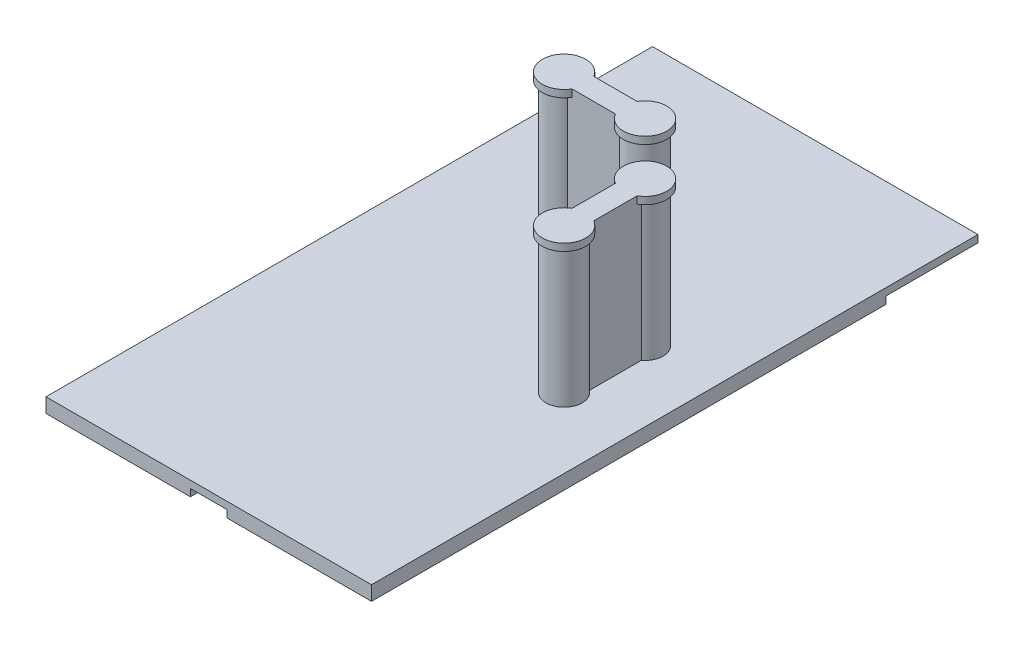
ISO-10303-21;
HEADER;
FILE_DESCRIPTION(('STEP AP214'),'2;1');
FILE_NAME('part.step','',(''),(''),'','','');
FILE_SCHEMA(('AUTOMOTIVE_DESIGN { 1 0 10303 214 1 1 1 1 }'));
ENDSEC;
DATA;
#1=APPLICATION_CONTEXT('core data for automotive mechanical design processes');
#2=APPLICATION_PROTOCOL_DEFINITION('international standard','automotive_design',2000,#1);
#3=PRODUCT_CONTEXT('',#1,'mechanical');
#4=PRODUCT('Part','Part','',(#3));
#5=PRODUCT_RELATED_PRODUCT_CATEGORY('part','',(#4));
#6=PRODUCT_DEFINITION_FORMATION('','',#4);
#7=PRODUCT_DEFINITION_CONTEXT('part definition',#1,'design');
#8=PRODUCT_DEFINITION('design','',#6,#7);
#9=PRODUCT_DEFINITION_SHAPE('','',#8);
#10=(LENGTH_UNIT() NAMED_UNIT(*) SI_UNIT(.MILLI.,.METRE.));
#11=(NAMED_UNIT(*) PLANE_ANGLE_UNIT() SI_UNIT($,.RADIAN.));
#12=(NAMED_UNIT(*) SI_UNIT($,.STERADIAN.) SOLID_ANGLE_UNIT());
#13=UNCERTAINTY_MEASURE_WITH_UNIT(LENGTH_MEASURE(1.E-05),#10,'distance_accuracy_value','');
#14=(GEOMETRIC_REPRESENTATION_CONTEXT(3) GLOBAL_UNCERTAINTY_ASSIGNED_CONTEXT((#13)) GLOBAL_UNIT_ASSIGNED_CONTEXT((#10,
#11,#12)) REPRESENTATION_CONTEXT('',''));
#15=CARTESIAN_POINT('',(0.,0.,0.));
#16=DIRECTION('',(0.,0.,1.));
#17=DIRECTION('',(1.,0.,0.));
#18=AXIS2_PLACEMENT_3D('',#15,#16,#17);
#19=CARTESIAN_POINT('',(12.8,22.,5.6));
#20=DIRECTION('',(0.,-1.,0.));
#21=DIRECTION('',(0.,0.,-1.));
#22=AXIS2_PLACEMENT_3D('',#19,#20,#21);
#23=CYLINDRICAL_SURFACE('',#22,2.5);
#24=CARTESIAN_POINT('',(12.8,21.,5.6));
#25=DIRECTION('',(0.,1.,0.));
#26=DIRECTION('',(0.,0.,1.));
#27=AXIS2_PLACEMENT_3D('',#24,#25,#26);
#28=CIRCLE('',#27,2.5);
#29=CARTESIAN_POINT('',(11.3,21.,3.6));
#30=VERTEX_POINT('',#29);
#31=CARTESIAN_POINT('',(14.3,21.,3.6));
#32=VERTEX_POINT('',#31);
#33=EDGE_CURVE('E270',#30,#32,#28,.T.);
#34=ORIENTED_EDGE('',*,*,#33,.F.);
#35=DIRECTION('',(0.,-1.,0.));
#36=VECTOR('',#35,1.);
#37=CARTESIAN_POINT('',(11.3,22.,3.6));
#38=LINE('',#37,#36);
#39=CARTESIAN_POINT('',(11.3,2.,3.6));
#40=VERTEX_POINT('',#39);
#41=EDGE_CURVE('E231',#30,#40,#38,.T.);
#42=ORIENTED_EDGE('',*,*,#41,.T.);
#43=CARTESIAN_POINT('',(12.8,2.,5.6));
#44=DIRECTION('',(0.,1.,0.));
#45=DIRECTION('',(0.,0.,1.));
#46=AXIS2_PLACEMENT_3D('',#43,#44,#45);
#47=CIRCLE('',#46,2.5);
#48=CARTESIAN_POINT('',(14.3,2.,3.6));
#49=VERTEX_POINT('',#48);
#50=EDGE_CURVE('E354',#40,#49,#47,.T.);
#51=ORIENTED_EDGE('',*,*,#50,.T.);
#52=DIRECTION('',(0.,-1.,0.));
#53=VECTOR('',#52,1.);
#54=CARTESIAN_POINT('',(14.3,22.,3.6));
#55=LINE('',#54,#53);
#56=EDGE_CURVE('E380',#32,#49,#55,.T.);
#57=ORIENTED_EDGE('',*,*,#56,.F.);
#58=EDGE_LOOP('',(#34,#42,#51,#57));
#59=FACE_BOUND('',#58,.T.);
#60=ADVANCED_FACE('F47',(#59),#23,.T.);
#61=CARTESIAN_POINT('',(12.8,22.,-5.6));
#62=DIRECTION('',(0.,-1.,0.));
#63=DIRECTION('',(0.,0.,-1.));
#64=AXIS2_PLACEMENT_3D('',#61,#62,#63);
#65=CYLINDRICAL_SURFACE('',#64,2.5);
#66=CARTESIAN_POINT('',(12.8,21.,-5.6));
#67=DIRECTION('',(0.,1.,0.));
#68=DIRECTION('',(0.,0.,1.));
#69=AXIS2_PLACEMENT_3D('',#66,#67,#68);
#70=CIRCLE('',#69,2.5);
#71=CARTESIAN_POINT('',(14.3,21.,-3.6));
#72=VERTEX_POINT('',#71);
#73=CARTESIAN_POINT('',(11.3,21.,-3.6));
#74=VERTEX_POINT('',#73);
#75=EDGE_CURVE('E260',#72,#74,#70,.T.);
#76=ORIENTED_EDGE('',*,*,#75,.F.);
#77=DIRECTION('',(0.,-1.,0.));
#78=VECTOR('',#77,1.);
#79=CARTESIAN_POINT('',(14.3,22.,-3.6));
#80=LINE('',#79,#78);
#81=CARTESIAN_POINT('',(14.3,2.,-3.6));
#82=VERTEX_POINT('',#81);
#83=EDGE_CURVE('E377',#72,#82,#80,.T.);
#84=ORIENTED_EDGE('',*,*,#83,.T.);
#85=CARTESIAN_POINT('',(12.8,2.,-5.6));
#86=DIRECTION('',(0.,1.,0.));
#87=DIRECTION('',(0.,0.,1.));
#88=AXIS2_PLACEMENT_3D('',#85,#86,#87);
#89=CIRCLE('',#88,2.5);
#90=CARTESIAN_POINT('',(11.3,2.,-3.6));
#91=VERTEX_POINT('',#90);
#92=EDGE_CURVE('E365',#82,#91,#89,.T.);
#93=ORIENTED_EDGE('',*,*,#92,.T.);
#94=DIRECTION('',(0.,-1.,0.));
#95=VECTOR('',#94,1.);
#96=CARTESIAN_POINT('',(11.3,22.,-3.6));
#97=LINE('',#96,#95);
#98=EDGE_CURVE('E374',#74,#91,#97,.T.);
#99=ORIENTED_EDGE('',*,*,#98,.F.);
#100=EDGE_LOOP('',(#76,#84,#93,#99));
#101=FACE_BOUND('',#100,.T.);
#102=ADVANCED_FACE('F503',(#101),#65,.T.);
#103=CARTESIAN_POINT('',(-5.6,22.,-12.8));
#104=DIRECTION('',(0.,-1.,0.));
#105=DIRECTION('',(0.,0.,-1.));
#106=AXIS2_PLACEMENT_3D('',#103,#104,#105);
#107=CYLINDRICAL_SURFACE('',#106,2.5);
#108=CARTESIAN_POINT('',(-5.6,21.,-12.8));
#109=DIRECTION('',(0.,1.,0.));
#110=DIRECTION('',(0.,0.,1.));
#111=AXIS2_PLACEMENT_3D('',#108,#109,#110);
#112=CIRCLE('',#111,2.5);
#113=CARTESIAN_POINT('',(-3.6,21.,-14.3));
#114=VERTEX_POINT('',#113);
#115=CARTESIAN_POINT('',(-3.6,21.,-11.3));
#116=VERTEX_POINT('',#115);
#117=EDGE_CURVE('E314',#114,#116,#112,.T.);
#118=ORIENTED_EDGE('',*,*,#117,.F.);
#119=DIRECTION('',(0.,-1.,0.));
#120=VECTOR('',#119,1.);
#121=CARTESIAN_POINT('',(-3.6,22.,-14.3));
#122=LINE('',#121,#120);
#123=CARTESIAN_POINT('',(-3.6,2.,-14.3));
#124=VERTEX_POINT('',#123);
#125=EDGE_CURVE('E327',#114,#124,#122,.T.);
#126=ORIENTED_EDGE('',*,*,#125,.T.);
#127=CARTESIAN_POINT('',(-5.6,2.,-12.8));
#128=DIRECTION('',(0.,1.,0.));
#129=DIRECTION('',(0.,0.,1.));
#130=AXIS2_PLACEMENT_3D('',#127,#128,#129);
#131=CIRCLE('',#130,2.5);
#132=CARTESIAN_POINT('',(-3.6,2.,-11.3));
#133=VERTEX_POINT('',#132);
#134=EDGE_CURVE('E328',#124,#133,#131,.T.);
#135=ORIENTED_EDGE('',*,*,#134,.T.);
#136=DIRECTION('',(0.,-1.,0.));
#137=VECTOR('',#136,1.);
#138=CARTESIAN_POINT('',(-3.6,22.,-11.3));
#139=LINE('',#138,#137);
#140=EDGE_CURVE('E351',#116,#133,#139,.T.);
#141=ORIENTED_EDGE('',*,*,#140,.F.);
#142=EDGE_LOOP('',(#118,#126,#135,#141));
#143=FACE_BOUND('',#142,.T.);
#144=ADVANCED_FACE('F529',(#143),#107,.T.);
#145=CARTESIAN_POINT('',(5.6,22.,-12.8));
#146=DIRECTION('',(0.,-1.,0.));
#147=DIRECTION('',(0.,0.,-1.));
#148=AXIS2_PLACEMENT_3D('',#145,#146,#147);
#149=CYLINDRICAL_SURFACE('',#148,2.5);
#150=CARTESIAN_POINT('',(5.6,21.,-12.8));
#151=DIRECTION('',(0.,1.,0.));
#152=DIRECTION('',(0.,0.,1.));
#153=AXIS2_PLACEMENT_3D('',#150,#151,#152);
#154=CIRCLE('',#153,2.5);
#155=CARTESIAN_POINT('',(3.6,21.,-11.3));
#156=VERTEX_POINT('',#155);
#157=CARTESIAN_POINT('',(3.6,21.,-14.3));
#158=VERTEX_POINT('',#157);
#159=EDGE_CURVE('E295',#156,#158,#154,.T.);
#160=ORIENTED_EDGE('',*,*,#159,.F.);
#161=DIRECTION('',(0.,-1.,0.));
#162=VECTOR('',#161,1.);
#163=CARTESIAN_POINT('',(3.6,22.,-11.3));
#164=LINE('',#163,#162);
#165=CARTESIAN_POINT('',(3.6,2.,-11.3));
#166=VERTEX_POINT('',#165);
#167=EDGE_CURVE('E348',#156,#166,#164,.T.);
#168=ORIENTED_EDGE('',*,*,#167,.T.);
#169=CARTESIAN_POINT('',(5.6,2.,-12.8));
#170=DIRECTION('',(0.,1.,0.));
#171=DIRECTION('',(0.,0.,1.));
#172=AXIS2_PLACEMENT_3D('',#169,#170,#171);
#173=CIRCLE('',#172,2.5);
#174=CARTESIAN_POINT('',(3.6,2.,-14.3));
#175=VERTEX_POINT('',#174);
#176=EDGE_CURVE('E336',#166,#175,#173,.T.);
#177=ORIENTED_EDGE('',*,*,#176,.T.);
#178=DIRECTION('',(0.,-1.,0.));
#179=VECTOR('',#178,1.);
#180=CARTESIAN_POINT('',(3.6,22.,-14.3));
#181=LINE('',#180,#179);
#182=EDGE_CURVE('E345',#158,#175,#181,.T.);
#183=ORIENTED_EDGE('',*,*,#182,.F.);
#184=EDGE_LOOP('',(#160,#168,#177,#183));
#185=FACE_BOUND('',#184,.T.);
#186=ADVANCED_FACE('F554',(#185),#149,.T.);
#187=CARTESIAN_POINT('',(0.,2.,0.));
#188=DIRECTION('',(0.,1.,0.));
#189=DIRECTION('',(0.,0.,1.));
#190=AXIS2_PLACEMENT_3D('',#187,#188,#189);
#191=PLANE('',#190);
#192=DIRECTION('',(0.,0.,1.));
#193=VECTOR('',#192,1.);
#194=CARTESIAN_POINT('',(-22.5,2.,41.93));
#195=LINE('',#194,#193);
#196=CARTESIAN_POINT('',(-22.5,2.,-41.93));
#197=VERTEX_POINT('',#196);
#198=CARTESIAN_POINT('',(-22.5,2.,41.93));
#199=VERTEX_POINT('',#198);
#200=EDGE_CURVE('E444',#197,#199,#195,.T.);
#201=ORIENTED_EDGE('',*,*,#200,.T.);
#202=DIRECTION('',(1.,0.,0.));
#203=VECTOR('',#202,1.);
#204=CARTESIAN_POINT('',(22.5,2.,41.93));
#205=LINE('',#204,#203);
#206=CARTESIAN_POINT('',(22.5,2.,41.93));
#207=VERTEX_POINT('',#206);
#208=EDGE_CURVE('E448',#199,#207,#205,.T.);
#209=ORIENTED_EDGE('',*,*,#208,.T.);
#210=DIRECTION('',(0.,0.,-1.));
#211=VECTOR('',#210,1.);
#212=CARTESIAN_POINT('',(22.5,2.,41.93));
#213=LINE('',#212,#211);
#214=CARTESIAN_POINT('',(22.5,2.,-41.93));
#215=VERTEX_POINT('',#214);
#216=EDGE_CURVE('E452',#207,#215,#213,.T.);
#217=ORIENTED_EDGE('',*,*,#216,.T.);
#218=DIRECTION('',(-1.,0.,0.));
#219=VECTOR('',#218,1.);
#220=CARTESIAN_POINT('',(22.5,2.,-41.93));
#221=LINE('',#220,#219);
#222=EDGE_CURVE('E455',#215,#197,#221,.T.);
#223=ORIENTED_EDGE('',*,*,#222,.T.);
#224=EDGE_LOOP('',(#201,#209,#217,#223));
#225=FACE_BOUND('',#224,.T.);
#226=DIRECTION('',(0.,0.,-1.));
#227=VECTOR('',#226,1.);
#228=CARTESIAN_POINT('',(14.3,2.,0.));
#229=LINE('',#228,#227);
#230=EDGE_CURVE('E361',#49,#82,#229,.T.);
#231=ORIENTED_EDGE('',*,*,#230,.F.);
#232=ORIENTED_EDGE('',*,*,#50,.F.);
#233=DIRECTION('',(0.,0.,-1.));
#234=VECTOR('',#233,1.);
#235=CARTESIAN_POINT('',(11.3,2.,0.));
#236=LINE('',#235,#234);
#237=EDGE_CURVE('E356',#40,#91,#236,.T.);
#238=ORIENTED_EDGE('',*,*,#237,.T.);
#239=ORIENTED_EDGE('',*,*,#92,.F.);
#240=EDGE_LOOP('',(#231,#232,#238,#239));
#241=FACE_BOUND('',#240,.T.);
#242=DIRECTION('',(1.,0.,0.));
#243=VECTOR('',#242,1.);
#244=CARTESIAN_POINT('',(0.,2.,-11.3));
#245=LINE('',#244,#243);
#246=EDGE_CURVE('E332',#133,#166,#245,.T.);
#247=ORIENTED_EDGE('',*,*,#246,.F.);
#248=ORIENTED_EDGE('',*,*,#134,.F.);
#249=DIRECTION('',(1.,0.,0.));
#250=VECTOR('',#249,1.);
#251=CARTESIAN_POINT('',(0.,2.,-14.3));
#252=LINE('',#251,#250);
#253=EDGE_CURVE('E324',#124,#175,#252,.T.);
#254=ORIENTED_EDGE('',*,*,#253,.T.);
#255=ORIENTED_EDGE('',*,*,#176,.F.);
#256=EDGE_LOOP('',(#247,#248,#254,#255));
#257=FACE_BOUND('',#256,.T.);
#258=ADVANCED_FACE('F551',(#225,#241,#257),#191,.T.);
#259=CARTESIAN_POINT('',(22.5,2.,-41.93));
#260=DIRECTION('',(0.,0.,1.));
#261=DIRECTION('',(1.,0.,0.));
#262=AXIS2_PLACEMENT_3D('',#259,#260,#261);
#263=PLANE('',#262);
#264=DIRECTION('',(1.,0.,0.));
#265=VECTOR('',#264,1.);
#266=CARTESIAN_POINT('',(22.5,1.,-41.93));
#267=LINE('',#266,#265);
#268=CARTESIAN_POINT('',(-22.5,1.,-41.93));
#269=VERTEX_POINT('',#268);
#270=CARTESIAN_POINT('',(22.5,1.,-41.93));
#271=VERTEX_POINT('',#270);
#272=EDGE_CURVE('E484',#269,#271,#267,.T.);
#273=ORIENTED_EDGE('',*,*,#272,.F.);
#274=DIRECTION('',(0.,-1.,0.));
#275=VECTOR('',#274,1.);
#276=CARTESIAN_POINT('',(-22.5,2.,-41.93));
#277=LINE('',#276,#275);
#278=EDGE_CURVE('E458',#197,#269,#277,.T.);
#279=ORIENTED_EDGE('',*,*,#278,.F.);
#280=ORIENTED_EDGE('',*,*,#222,.F.);
#281=DIRECTION('',(0.,-1.,0.));
#282=VECTOR('',#281,1.);
#283=CARTESIAN_POINT('',(22.5,2.,-41.93));
#284=LINE('',#283,#282);
#285=EDGE_CURVE('E472',#215,#271,#284,.T.);
#286=ORIENTED_EDGE('',*,*,#285,.T.);
#287=EDGE_LOOP('',(#273,#279,#280,#286));
#288=FACE_BOUND('',#287,.T.);
#289=ADVANCED_FACE('F553',(#288),#263,.F.);
#290=CARTESIAN_POINT('',(-22.5,2.,41.93));
#291=DIRECTION('',(1.,0.,0.));
#292=DIRECTION('',(0.,0.,-1.));
#293=AXIS2_PLACEMENT_3D('',#290,#291,#292);
#294=PLANE('',#293);
#295=DIRECTION('',(0.,0.,-1.));
#296=VECTOR('',#295,1.);
#297=CARTESIAN_POINT('',(-22.5,1.,-54.63));
#298=LINE('',#297,#296);
#299=CARTESIAN_POINT('',(-22.5,1.,-29.23));
#300=VERTEX_POINT('',#299);
#301=EDGE_CURVE('E424',#300,#269,#298,.T.);
#302=ORIENTED_EDGE('',*,*,#301,.F.);
#303=DIRECTION('',(0.,-1.,0.));
#304=VECTOR('',#303,1.);
#305=CARTESIAN_POINT('',(-22.5,1.,-29.23));
#306=LINE('',#305,#304);
#307=CARTESIAN_POINT('',(-22.5,0.,-29.23));
#308=VERTEX_POINT('',#307);
#309=EDGE_CURVE('E437',#300,#308,#306,.T.);
#310=ORIENTED_EDGE('',*,*,#309,.T.);
#311=DIRECTION('',(0.,0.,1.));
#312=VECTOR('',#311,1.);
#313=CARTESIAN_POINT('',(-22.5,0.,41.93));
#314=LINE('',#313,#312);
#315=CARTESIAN_POINT('',(-22.5,0.,41.93));
#316=VERTEX_POINT('',#315);
#317=EDGE_CURVE('E441',#308,#316,#314,.T.);
#318=ORIENTED_EDGE('',*,*,#317,.T.);
#319=DIRECTION('',(0.,-1.,0.));
#320=VECTOR('',#319,1.);
#321=CARTESIAN_POINT('',(-22.5,2.,41.93));
#322=LINE('',#321,#320);
#323=EDGE_CURVE('E480',#199,#316,#322,.T.);
#324=ORIENTED_EDGE('',*,*,#323,.F.);
#325=ORIENTED_EDGE('',*,*,#200,.F.);
#326=ORIENTED_EDGE('',*,*,#278,.T.);
#327=EDGE_LOOP('',(#302,#310,#318,#324,#325,#326));
#328=FACE_BOUND('',#327,.T.);
#329=ADVANCED_FACE('F49',(#328),#294,.F.);
#330=CARTESIAN_POINT('',(22.5,2.,41.93));
#331=DIRECTION('',(0.,0.,-1.));
#332=DIRECTION('',(-1.,0.,0.));
#333=AXIS2_PLACEMENT_3D('',#330,#331,#332);
#334=PLANE('',#333);
#335=DIRECTION('',(1.,0.,0.));
#336=VECTOR('',#335,1.);
#337=CARTESIAN_POINT('',(22.5,0.,41.93));
#338=LINE('',#337,#336);
#339=CARTESIAN_POINT('',(-2.54,0.,41.93));
#340=VERTEX_POINT('',#339);
#341=EDGE_CURVE('E462',#316,#340,#338,.T.);
#342=ORIENTED_EDGE('',*,*,#341,.T.);
#343=DIRECTION('',(0.,-1.,0.));
#344=VECTOR('',#343,1.);
#345=CARTESIAN_POINT('',(-2.54,1.,41.93));
#346=LINE('',#345,#344);
#347=CARTESIAN_POINT('',(-2.54,1.,41.93));
#348=VERTEX_POINT('',#347);
#349=EDGE_CURVE('E410',#348,#340,#346,.T.);
#350=ORIENTED_EDGE('',*,*,#349,.F.);
#351=DIRECTION('',(-1.,0.,0.));
#352=VECTOR('',#351,1.);
#353=CARTESIAN_POINT('',(2.54,1.,41.93));
#354=LINE('',#353,#352);
#355=CARTESIAN_POINT('',(2.54,1.,41.93));
#356=VERTEX_POINT('',#355);
#357=EDGE_CURVE('E397',#356,#348,#354,.T.);
#358=ORIENTED_EDGE('',*,*,#357,.F.);
#359=DIRECTION('',(0.,-1.,0.));
#360=VECTOR('',#359,1.);
#361=CARTESIAN_POINT('',(2.54,1.,41.93));
#362=LINE('',#361,#360);
#363=CARTESIAN_POINT('',(2.54,0.,41.93));
#364=VERTEX_POINT('',#363);
#365=EDGE_CURVE('E414',#356,#364,#362,.T.);
#366=ORIENTED_EDGE('',*,*,#365,.T.);
#367=CARTESIAN_POINT('',(22.5,0.,41.93));
#368=VERTEX_POINT('',#367);
#369=EDGE_CURVE('E461',#364,#368,#338,.T.);
#370=ORIENTED_EDGE('',*,*,#369,.T.);
#371=DIRECTION('',(0.,-1.,0.));
#372=VECTOR('',#371,1.);
#373=CARTESIAN_POINT('',(22.5,2.,41.93));
#374=LINE('',#373,#372);
#375=EDGE_CURVE('E476',#207,#368,#374,.T.);
#376=ORIENTED_EDGE('',*,*,#375,.F.);
#377=ORIENTED_EDGE('',*,*,#208,.F.);
#378=ORIENTED_EDGE('',*,*,#323,.T.);
#379=EDGE_LOOP('',(#342,#350,#358,#366,#370,#376,#377,#378));
#380=FACE_BOUND('',#379,.T.);
#381=ADVANCED_FACE('F564',(#380),#334,.F.);
#382=CARTESIAN_POINT('',(22.5,2.,41.93));
#383=DIRECTION('',(-1.,0.,0.));
#384=DIRECTION('',(0.,0.,1.));
#385=AXIS2_PLACEMENT_3D('',#382,#383,#384);
#386=PLANE('',#385);
#387=DIRECTION('',(0.,0.,-1.));
#388=VECTOR('',#387,1.);
#389=CARTESIAN_POINT('',(22.5,0.,41.93));
#390=LINE('',#389,#388);
#391=CARTESIAN_POINT('',(22.5,0.,-29.23));
#392=VERTEX_POINT('',#391);
#393=EDGE_CURVE('E449',#368,#392,#390,.T.);
#394=ORIENTED_EDGE('',*,*,#393,.T.);
#395=DIRECTION('',(0.,-1.,0.));
#396=VECTOR('',#395,1.);
#397=CARTESIAN_POINT('',(22.5,1.,-29.23));
#398=LINE('',#397,#396);
#399=CARTESIAN_POINT('',(22.5,1.,-29.23));
#400=VERTEX_POINT('',#399);
#401=EDGE_CURVE('E434',#400,#392,#398,.T.);
#402=ORIENTED_EDGE('',*,*,#401,.F.);
#403=DIRECTION('',(0.,0.,1.));
#404=VECTOR('',#403,1.);
#405=CARTESIAN_POINT('',(22.5,1.,-54.63));
#406=LINE('',#405,#404);
#407=EDGE_CURVE('E427',#271,#400,#406,.T.);
#408=ORIENTED_EDGE('',*,*,#407,.F.);
#409=ORIENTED_EDGE('',*,*,#285,.F.);
#410=ORIENTED_EDGE('',*,*,#216,.F.);
#411=ORIENTED_EDGE('',*,*,#375,.T.);
#412=EDGE_LOOP('',(#394,#402,#408,#409,#410,#411));
#413=FACE_BOUND('',#412,.T.);
#414=ADVANCED_FACE('F558',(#413),#386,.F.);
#415=CARTESIAN_POINT('',(0.,0.,0.));
#416=DIRECTION('',(0.,1.,0.));
#417=DIRECTION('',(0.,0.,1.));
#418=AXIS2_PLACEMENT_3D('',#415,#416,#417);
#419=PLANE('',#418);
#420=DIRECTION('',(1.,0.,0.));
#421=VECTOR('',#420,1.);
#422=CARTESIAN_POINT('',(2.54,0.,16.53));
#423=LINE('',#422,#421);
#424=CARTESIAN_POINT('',(-2.54,0.,16.53));
#425=VERTEX_POINT('',#424);
#426=CARTESIAN_POINT('',(2.54,0.,16.53));
#427=VERTEX_POINT('',#426);
#428=EDGE_CURVE('E404',#425,#427,#423,.T.);
#429=ORIENTED_EDGE('',*,*,#428,.F.);
#430=DIRECTION('',(0.,0.,-1.));
#431=VECTOR('',#430,1.);
#432=CARTESIAN_POINT('',(-2.54,0.,16.53));
#433=LINE('',#432,#431);
#434=EDGE_CURVE('E383',#340,#425,#433,.T.);
#435=ORIENTED_EDGE('',*,*,#434,.F.);
#436=ORIENTED_EDGE('',*,*,#341,.F.);
#437=ORIENTED_EDGE('',*,*,#317,.F.);
#438=DIRECTION('',(-1.,0.,0.));
#439=VECTOR('',#438,1.);
#440=CARTESIAN_POINT('',(22.5,0.,-29.23));
#441=LINE('',#440,#439);
#442=EDGE_CURVE('E413',#392,#308,#441,.T.);
#443=ORIENTED_EDGE('',*,*,#442,.F.);
#444=ORIENTED_EDGE('',*,*,#393,.F.);
#445=ORIENTED_EDGE('',*,*,#369,.F.);
#446=DIRECTION('',(0.,0.,1.));
#447=VECTOR('',#446,1.);
#448=CARTESIAN_POINT('',(2.54,0.,16.53));
#449=LINE('',#448,#447);
#450=EDGE_CURVE('E389',#427,#364,#449,.T.);
#451=ORIENTED_EDGE('',*,*,#450,.F.);
#452=EDGE_LOOP('',(#429,#435,#436,#437,#443,#444,#445,#451));
#453=FACE_BOUND('',#452,.T.);
#454=ADVANCED_FACE('F546',(#453),#419,.F.);
#455=CARTESIAN_POINT('',(0.,1.,0.));
#456=DIRECTION('',(0.,-1.,0.));
#457=DIRECTION('',(0.,0.,-1.));
#458=AXIS2_PLACEMENT_3D('',#455,#456,#457);
#459=PLANE('',#458);
#460=ORIENTED_EDGE('',*,*,#272,.T.);
#461=ORIENTED_EDGE('',*,*,#407,.T.);
#462=DIRECTION('',(-1.,0.,0.));
#463=VECTOR('',#462,1.);
#464=CARTESIAN_POINT('',(22.5,1.,-29.23));
#465=LINE('',#464,#463);
#466=EDGE_CURVE('E430',#400,#300,#465,.T.);
#467=ORIENTED_EDGE('',*,*,#466,.T.);
#468=ORIENTED_EDGE('',*,*,#301,.T.);
#469=EDGE_LOOP('',(#460,#461,#467,#468));
#470=FACE_BOUND('',#469,.T.);
#471=ADVANCED_FACE('F543',(#470),#459,.T.);
#472=CARTESIAN_POINT('',(22.5,1.,-29.23));
#473=DIRECTION('',(0.,0.,1.));
#474=DIRECTION('',(1.,0.,0.));
#475=AXIS2_PLACEMENT_3D('',#472,#473,#474);
#476=PLANE('',#475);
#477=ORIENTED_EDGE('',*,*,#442,.T.);
#478=ORIENTED_EDGE('',*,*,#309,.F.);
#479=ORIENTED_EDGE('',*,*,#466,.F.);
#480=ORIENTED_EDGE('',*,*,#401,.T.);
#481=EDGE_LOOP('',(#477,#478,#479,#480));
#482=FACE_BOUND('',#481,.T.);
#483=ADVANCED_FACE('F541',(#482),#476,.F.);
#484=CARTESIAN_POINT('',(-2.54,1.,16.53));
#485=DIRECTION('',(-1.,0.,0.));
#486=DIRECTION('',(0.,0.,1.));
#487=AXIS2_PLACEMENT_3D('',#484,#485,#486);
#488=PLANE('',#487);
#489=ORIENTED_EDGE('',*,*,#434,.T.);
#490=DIRECTION('',(0.,-1.,0.));
#491=VECTOR('',#490,1.);
#492=CARTESIAN_POINT('',(-2.54,1.,16.53));
#493=LINE('',#492,#491);
#494=CARTESIAN_POINT('',(-2.54,1.,16.53));
#495=VERTEX_POINT('',#494);
#496=EDGE_CURVE('E401',#495,#425,#493,.T.);
#497=ORIENTED_EDGE('',*,*,#496,.F.);
#498=DIRECTION('',(0.,0.,-1.));
#499=VECTOR('',#498,1.);
#500=CARTESIAN_POINT('',(-2.54,1.,16.53));
#501=LINE('',#500,#499);
#502=EDGE_CURVE('E384',#348,#495,#501,.T.);
#503=ORIENTED_EDGE('',*,*,#502,.F.);
#504=ORIENTED_EDGE('',*,*,#349,.T.);
#505=EDGE_LOOP('',(#489,#497,#503,#504));
#506=FACE_BOUND('',#505,.T.);
#507=ADVANCED_FACE('F534',(#506),#488,.F.);
#508=CARTESIAN_POINT('',(2.54,1.,16.53));
#509=DIRECTION('',(1.,0.,0.));
#510=DIRECTION('',(0.,0.,-1.));
#511=AXIS2_PLACEMENT_3D('',#508,#509,#510);
#512=PLANE('',#511);
#513=ORIENTED_EDGE('',*,*,#450,.T.);
#514=ORIENTED_EDGE('',*,*,#365,.F.);
#515=DIRECTION('',(0.,0.,1.));
#516=VECTOR('',#515,1.);
#517=CARTESIAN_POINT('',(2.54,1.,16.53));
#518=LINE('',#517,#516);
#519=CARTESIAN_POINT('',(2.54,1.,16.53));
#520=VERTEX_POINT('',#519);
#521=EDGE_CURVE('E393',#520,#356,#518,.T.);
#522=ORIENTED_EDGE('',*,*,#521,.F.);
#523=DIRECTION('',(0.,-1.,0.));
#524=VECTOR('',#523,1.);
#525=CARTESIAN_POINT('',(2.54,1.,16.53));
#526=LINE('',#525,#524);
#527=EDGE_CURVE('E418',#520,#427,#526,.T.);
#528=ORIENTED_EDGE('',*,*,#527,.T.);
#529=EDGE_LOOP('',(#513,#514,#522,#528));
#530=FACE_BOUND('',#529,.T.);
#531=ADVANCED_FACE('F531',(#530),#512,.F.);
#532=CARTESIAN_POINT('',(2.54,1.,16.53));
#533=DIRECTION('',(0.,0.,-1.));
#534=DIRECTION('',(-1.,0.,0.));
#535=AXIS2_PLACEMENT_3D('',#532,#533,#534);
#536=PLANE('',#535);
#537=ORIENTED_EDGE('',*,*,#428,.T.);
#538=ORIENTED_EDGE('',*,*,#527,.F.);
#539=DIRECTION('',(1.,0.,0.));
#540=VECTOR('',#539,1.);
#541=CARTESIAN_POINT('',(2.54,1.,16.53));
#542=LINE('',#541,#540);
#543=EDGE_CURVE('E388',#495,#520,#542,.T.);
#544=ORIENTED_EDGE('',*,*,#543,.F.);
#545=ORIENTED_EDGE('',*,*,#496,.T.);
#546=EDGE_LOOP('',(#537,#538,#544,#545));
#547=FACE_BOUND('',#546,.T.);
#548=ADVANCED_FACE('F518',(#547),#536,.F.);
#549=CARTESIAN_POINT('',(0.,1.,0.));
#550=DIRECTION('',(0.,-1.,0.));
#551=DIRECTION('',(0.,0.,-1.));
#552=AXIS2_PLACEMENT_3D('',#549,#550,#551);
#553=PLANE('',#552);
#554=ORIENTED_EDGE('',*,*,#502,.T.);
#555=ORIENTED_EDGE('',*,*,#543,.T.);
#556=ORIENTED_EDGE('',*,*,#521,.T.);
#557=ORIENTED_EDGE('',*,*,#357,.T.);
#558=EDGE_LOOP('',(#554,#555,#556,#557));
#559=FACE_BOUND('',#558,.T.);
#560=ADVANCED_FACE('F510',(#559),#553,.T.);
#561=CARTESIAN_POINT('',(14.3,22.,0.));
#562=DIRECTION('',(-1.,0.,0.));
#563=DIRECTION('',(0.,0.,1.));
#564=AXIS2_PLACEMENT_3D('',#561,#562,#563);
#565=PLANE('',#564);
#566=DIRECTION('',(0.,1.,0.));
#567=VECTOR('',#566,1.);
#568=CARTESIAN_POINT('',(14.3,21.,3.00192378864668));
#569=LINE('',#568,#567);
#570=CARTESIAN_POINT('',(14.3,21.,3.00192378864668));
#571=VERTEX_POINT('',#570);
#572=CARTESIAN_POINT('',(14.3,22.,3.00192378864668));
#573=VERTEX_POINT('',#572);
#574=EDGE_CURVE('E63',#571,#573,#569,.T.);
#575=ORIENTED_EDGE('',*,*,#574,.F.);
#576=DIRECTION('',(0.,0.,-1.));
#577=VECTOR('',#576,1.);
#578=CARTESIAN_POINT('',(14.3,21.,0.));
#579=LINE('',#578,#577);
#580=EDGE_CURVE('E271',#32,#571,#579,.T.);
#581=ORIENTED_EDGE('',*,*,#580,.F.);
#582=ORIENTED_EDGE('',*,*,#56,.T.);
#583=ORIENTED_EDGE('',*,*,#230,.T.);
#584=ORIENTED_EDGE('',*,*,#83,.F.);
#585=CARTESIAN_POINT('',(14.3,21.,-3.00192378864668));
#586=VERTEX_POINT('',#585);
#587=EDGE_CURVE('E70',#586,#72,#579,.T.);
#588=ORIENTED_EDGE('',*,*,#587,.F.);
#589=DIRECTION('',(0.,1.,0.));
#590=VECTOR('',#589,1.);
#591=CARTESIAN_POINT('',(14.3,21.,-3.00192378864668));
#592=LINE('',#591,#590);
#593=CARTESIAN_POINT('',(14.3,22.,-3.00192378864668));
#594=VERTEX_POINT('',#593);
#595=EDGE_CURVE('E257',#586,#594,#592,.T.);
#596=ORIENTED_EDGE('',*,*,#595,.T.);
#597=DIRECTION('',(0.,0.,-1.));
#598=VECTOR('',#597,1.);
#599=CARTESIAN_POINT('',(14.3,22.,0.));
#600=LINE('',#599,#598);
#601=EDGE_CURVE('E232',#573,#594,#600,.T.);
#602=ORIENTED_EDGE('',*,*,#601,.F.);
#603=EDGE_LOOP('',(#575,#581,#582,#583,#584,#588,#596,#602));
#604=FACE_BOUND('',#603,.T.);
#605=ADVANCED_FACE('F508',(#604),#565,.F.);
#606=CARTESIAN_POINT('',(11.3,22.,0.));
#607=DIRECTION('',(-1.,0.,0.));
#608=DIRECTION('',(0.,0.,1.));
#609=AXIS2_PLACEMENT_3D('',#606,#607,#608);
#610=PLANE('',#609);
#611=DIRECTION('',(0.,1.,0.));
#612=VECTOR('',#611,1.);
#613=CARTESIAN_POINT('',(11.3,21.,-3.00192378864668));
#614=LINE('',#613,#612);
#615=CARTESIAN_POINT('',(11.3,21.,-3.00192378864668));
#616=VERTEX_POINT('',#615);
#617=CARTESIAN_POINT('',(11.3,22.,-3.00192378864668));
#618=VERTEX_POINT('',#617);
#619=EDGE_CURVE('E243',#616,#618,#614,.T.);
#620=ORIENTED_EDGE('',*,*,#619,.F.);
#621=DIRECTION('',(0.,0.,-1.));
#622=VECTOR('',#621,1.);
#623=CARTESIAN_POINT('',(11.3,21.,0.));
#624=LINE('',#623,#622);
#625=EDGE_CURVE('E51',#616,#74,#624,.T.);
#626=ORIENTED_EDGE('',*,*,#625,.T.);
#627=ORIENTED_EDGE('',*,*,#98,.T.);
#628=ORIENTED_EDGE('',*,*,#237,.F.);
#629=ORIENTED_EDGE('',*,*,#41,.F.);
#630=CARTESIAN_POINT('',(11.3,21.,3.00192378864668));
#631=VERTEX_POINT('',#630);
#632=EDGE_CURVE('E11',#30,#631,#624,.T.);
#633=ORIENTED_EDGE('',*,*,#632,.T.);
#634=DIRECTION('',(0.,1.,0.));
#635=VECTOR('',#634,1.);
#636=CARTESIAN_POINT('',(11.3,21.,3.00192378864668));
#637=LINE('',#636,#635);
#638=CARTESIAN_POINT('',(11.3,22.,3.00192378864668));
#639=VERTEX_POINT('',#638);
#640=EDGE_CURVE('E235',#631,#639,#637,.T.);
#641=ORIENTED_EDGE('',*,*,#640,.T.);
#642=DIRECTION('',(0.,0.,-1.));
#643=VECTOR('',#642,1.);
#644=CARTESIAN_POINT('',(11.3,22.,0.));
#645=LINE('',#644,#643);
#646=EDGE_CURVE('E220',#639,#618,#645,.T.);
#647=ORIENTED_EDGE('',*,*,#646,.T.);
#648=EDGE_LOOP('',(#620,#626,#627,#628,#629,#633,#641,#647));
#649=FACE_BOUND('',#648,.T.);
#650=ADVANCED_FACE('F236',(#649),#610,.T.);
#651=CARTESIAN_POINT('',(0.,22.,0.));
#652=DIRECTION('',(0.,1.,0.));
#653=DIRECTION('',(0.,0.,1.));
#654=AXIS2_PLACEMENT_3D('',#651,#652,#653);
#655=PLANE('',#654);
#656=CARTESIAN_POINT('',(12.8,22.,5.6));
#657=DIRECTION('',(0.,1.,0.));
#658=DIRECTION('',(0.,0.,1.));
#659=AXIS2_PLACEMENT_3D('',#656,#657,#658);
#660=CIRCLE('',#659,3.);
#661=EDGE_CURVE('E225',#639,#573,#660,.T.);
#662=ORIENTED_EDGE('',*,*,#661,.T.);
#663=ORIENTED_EDGE('',*,*,#601,.T.);
#664=CARTESIAN_POINT('',(12.8,22.,-5.6));
#665=DIRECTION('',(0.,1.,0.));
#666=DIRECTION('',(0.,0.,1.));
#667=AXIS2_PLACEMENT_3D('',#664,#665,#666);
#668=CIRCLE('',#667,3.);
#669=EDGE_CURVE('E227',#594,#618,#668,.T.);
#670=ORIENTED_EDGE('',*,*,#669,.T.);
#671=ORIENTED_EDGE('',*,*,#646,.F.);
#672=EDGE_LOOP('',(#662,#663,#670,#671));
#673=FACE_BOUND('',#672,.T.);
#674=ADVANCED_FACE('F222',(#673),#655,.T.);
#675=CARTESIAN_POINT('',(0.,22.,-11.3));
#676=DIRECTION('',(0.,0.,-1.));
#677=DIRECTION('',(-1.,0.,0.));
#678=AXIS2_PLACEMENT_3D('',#675,#676,#677);
#679=PLANE('',#678);
#680=DIRECTION('',(0.,1.,0.));
#681=VECTOR('',#680,1.);
#682=CARTESIAN_POINT('',(-3.00192378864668,21.,-11.3));
#683=LINE('',#682,#681);
#684=CARTESIAN_POINT('',(-3.00192378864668,21.,-11.3));
#685=VERTEX_POINT('',#684);
#686=CARTESIAN_POINT('',(-3.00192378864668,22.,-11.3));
#687=VERTEX_POINT('',#686);
#688=EDGE_CURVE('E296',#685,#687,#683,.T.);
#689=ORIENTED_EDGE('',*,*,#688,.F.);
#690=DIRECTION('',(1.,0.,0.));
#691=VECTOR('',#690,1.);
#692=CARTESIAN_POINT('',(0.,21.,-11.3));
#693=LINE('',#692,#691);
#694=EDGE_CURVE('E315',#116,#685,#693,.T.);
#695=ORIENTED_EDGE('',*,*,#694,.F.);
#696=ORIENTED_EDGE('',*,*,#140,.T.);
#697=ORIENTED_EDGE('',*,*,#246,.T.);
#698=ORIENTED_EDGE('',*,*,#167,.F.);
#699=CARTESIAN_POINT('',(3.00192378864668,21.,-11.3));
#700=VERTEX_POINT('',#699);
#701=EDGE_CURVE('E310',#700,#156,#693,.T.);
#702=ORIENTED_EDGE('',*,*,#701,.F.);
#703=DIRECTION('',(0.,1.,0.));
#704=VECTOR('',#703,1.);
#705=CARTESIAN_POINT('',(3.00192378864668,21.,-11.3));
#706=LINE('',#705,#704);
#707=CARTESIAN_POINT('',(3.00192378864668,22.,-11.3));
#708=VERTEX_POINT('',#707);
#709=EDGE_CURVE('E292',#700,#708,#706,.T.);
#710=ORIENTED_EDGE('',*,*,#709,.T.);
#711=DIRECTION('',(1.,0.,0.));
#712=VECTOR('',#711,1.);
#713=CARTESIAN_POINT('',(0.,22.,-11.3));
#714=LINE('',#713,#712);
#715=EDGE_CURVE('E319',#687,#708,#714,.T.);
#716=ORIENTED_EDGE('',*,*,#715,.F.);
#717=EDGE_LOOP('',(#689,#695,#696,#697,#698,#702,#710,#716));
#718=FACE_BOUND('',#717,.T.);
#719=ADVANCED_FACE('F620',(#718),#679,.F.);
#720=CARTESIAN_POINT('',(0.,22.,-14.3));
#721=DIRECTION('',(0.,0.,-1.));
#722=DIRECTION('',(-1.,0.,0.));
#723=AXIS2_PLACEMENT_3D('',#720,#721,#722);
#724=PLANE('',#723);
#725=DIRECTION('',(0.,1.,0.));
#726=VECTOR('',#725,1.);
#727=CARTESIAN_POINT('',(3.00192378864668,21.,-14.3));
#728=LINE('',#727,#726);
#729=CARTESIAN_POINT('',(3.00192378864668,21.,-14.3));
#730=VERTEX_POINT('',#729);
#731=CARTESIAN_POINT('',(3.00192378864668,22.,-14.3));
#732=VERTEX_POINT('',#731);
#733=EDGE_CURVE('E284',#730,#732,#728,.T.);
#734=ORIENTED_EDGE('',*,*,#733,.F.);
#735=DIRECTION('',(1.,0.,0.));
#736=VECTOR('',#735,1.);
#737=CARTESIAN_POINT('',(0.,21.,-14.3));
#738=LINE('',#737,#736);
#739=EDGE_CURVE('E486',#730,#158,#738,.T.);
#740=ORIENTED_EDGE('',*,*,#739,.T.);
#741=ORIENTED_EDGE('',*,*,#182,.T.);
#742=ORIENTED_EDGE('',*,*,#253,.F.);
#743=ORIENTED_EDGE('',*,*,#125,.F.);
#744=CARTESIAN_POINT('',(-3.00192378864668,21.,-14.3));
#745=VERTEX_POINT('',#744);
#746=EDGE_CURVE('E488',#114,#745,#738,.T.);
#747=ORIENTED_EDGE('',*,*,#746,.T.);
#748=DIRECTION('',(0.,1.,0.));
#749=VECTOR('',#748,1.);
#750=CARTESIAN_POINT('',(-3.00192378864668,21.,-14.3));
#751=LINE('',#750,#749);
#752=CARTESIAN_POINT('',(-3.00192378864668,22.,-14.3));
#753=VERTEX_POINT('',#752);
#754=EDGE_CURVE('E300',#745,#753,#751,.T.);
#755=ORIENTED_EDGE('',*,*,#754,.T.);
#756=DIRECTION('',(1.,0.,0.));
#757=VECTOR('',#756,1.);
#758=CARTESIAN_POINT('',(0.,22.,-14.3));
#759=LINE('',#758,#757);
#760=EDGE_CURVE('E323',#753,#732,#759,.T.);
#761=ORIENTED_EDGE('',*,*,#760,.T.);
#762=EDGE_LOOP('',(#734,#740,#741,#742,#743,#747,#755,#761));
#763=FACE_BOUND('',#762,.T.);
#764=ADVANCED_FACE('F606',(#763),#724,.T.);
#765=CARTESIAN_POINT('',(0.,22.,0.));
#766=DIRECTION('',(0.,1.,0.));
#767=DIRECTION('',(0.,0.,1.));
#768=AXIS2_PLACEMENT_3D('',#765,#766,#767);
#769=PLANE('',#768);
#770=CARTESIAN_POINT('',(-5.6,22.,-12.8));
#771=DIRECTION('',(0.,1.,0.));
#772=DIRECTION('',(0.,0.,1.));
#773=AXIS2_PLACEMENT_3D('',#770,#771,#772);
#774=CIRCLE('',#773,3.);
#775=EDGE_CURVE('E280',#753,#687,#774,.T.);
#776=ORIENTED_EDGE('',*,*,#775,.T.);
#777=ORIENTED_EDGE('',*,*,#715,.T.);
#778=CARTESIAN_POINT('',(5.6,22.,-12.8));
#779=DIRECTION('',(0.,1.,0.));
#780=DIRECTION('',(0.,0.,1.));
#781=AXIS2_PLACEMENT_3D('',#778,#779,#780);
#782=CIRCLE('',#781,3.);
#783=EDGE_CURVE('E285',#708,#732,#782,.T.);
#784=ORIENTED_EDGE('',*,*,#783,.T.);
#785=ORIENTED_EDGE('',*,*,#760,.F.);
#786=EDGE_LOOP('',(#776,#777,#784,#785));
#787=FACE_BOUND('',#786,.T.);
#788=ADVANCED_FACE('F619',(#787),#769,.T.);
#789=CARTESIAN_POINT('',(0.,21.,0.));
#790=DIRECTION('',(0.,1.,0.));
#791=DIRECTION('',(0.,0.,1.));
#792=AXIS2_PLACEMENT_3D('',#789,#790,#791);
#793=PLANE('',#792);
#794=CARTESIAN_POINT('',(5.6,21.,-12.8));
#795=DIRECTION('',(0.,1.,0.));
#796=DIRECTION('',(0.,0.,1.));
#797=AXIS2_PLACEMENT_3D('',#794,#795,#796);
#798=CIRCLE('',#797,3.);
#799=EDGE_CURVE('E275',#700,#730,#798,.T.);
#800=ORIENTED_EDGE('',*,*,#799,.F.);
#801=ORIENTED_EDGE('',*,*,#701,.T.);
#802=ORIENTED_EDGE('',*,*,#159,.T.);
#803=ORIENTED_EDGE('',*,*,#739,.F.);
#804=EDGE_LOOP('',(#800,#801,#802,#803));
#805=FACE_BOUND('',#804,.T.);
#806=ADVANCED_FACE('F622',(#805),#793,.F.);
#807=CARTESIAN_POINT('',(5.6,21.,-12.8));
#808=DIRECTION('',(0.,1.,0.));
#809=DIRECTION('',(0.,0.,1.));
#810=AXIS2_PLACEMENT_3D('',#807,#808,#809);
#811=CYLINDRICAL_SURFACE('',#810,3.);
#812=ORIENTED_EDGE('',*,*,#783,.F.);
#813=ORIENTED_EDGE('',*,*,#709,.F.);
#814=ORIENTED_EDGE('',*,*,#799,.T.);
#815=ORIENTED_EDGE('',*,*,#733,.T.);
#816=EDGE_LOOP('',(#812,#813,#814,#815));
#817=FACE_BOUND('',#816,.T.);
#818=ADVANCED_FACE('F616',(#817),#811,.T.);
#819=ORIENTED_EDGE('',*,*,#117,.T.);
#820=ORIENTED_EDGE('',*,*,#694,.T.);
#821=CARTESIAN_POINT('',(-5.6,21.,-12.8));
#822=DIRECTION('',(0.,1.,0.));
#823=DIRECTION('',(0.,0.,1.));
#824=AXIS2_PLACEMENT_3D('',#821,#822,#823);
#825=CIRCLE('',#824,3.);
#826=EDGE_CURVE('E279',#745,#685,#825,.T.);
#827=ORIENTED_EDGE('',*,*,#826,.F.);
#828=ORIENTED_EDGE('',*,*,#746,.F.);
#829=EDGE_LOOP('',(#819,#820,#827,#828));
#830=FACE_BOUND('',#829,.T.);
#831=ADVANCED_FACE('F609',(#830),#793,.F.);
#832=CARTESIAN_POINT('',(-5.6,21.,-12.8));
#833=DIRECTION('',(0.,1.,0.));
#834=DIRECTION('',(0.,0.,1.));
#835=AXIS2_PLACEMENT_3D('',#832,#833,#834);
#836=CYLINDRICAL_SURFACE('',#835,3.);
#837=ORIENTED_EDGE('',*,*,#775,.F.);
#838=ORIENTED_EDGE('',*,*,#754,.F.);
#839=ORIENTED_EDGE('',*,*,#826,.T.);
#840=ORIENTED_EDGE('',*,*,#688,.T.);
#841=EDGE_LOOP('',(#837,#838,#839,#840));
#842=FACE_BOUND('',#841,.T.);
#843=ADVANCED_FACE('F612',(#842),#836,.T.);
#844=CARTESIAN_POINT('',(0.,21.,0.));
#845=DIRECTION('',(0.,1.,0.));
#846=DIRECTION('',(0.,0.,1.));
#847=AXIS2_PLACEMENT_3D('',#844,#845,#846);
#848=PLANE('',#847);
#849=CARTESIAN_POINT('',(12.8,21.,-5.6));
#850=DIRECTION('',(0.,1.,0.));
#851=DIRECTION('',(0.,0.,1.));
#852=AXIS2_PLACEMENT_3D('',#849,#850,#851);
#853=CIRCLE('',#852,3.);
#854=EDGE_CURVE('E247',#586,#616,#853,.T.);
#855=ORIENTED_EDGE('',*,*,#854,.F.);
#856=ORIENTED_EDGE('',*,*,#587,.T.);
#857=ORIENTED_EDGE('',*,*,#75,.T.);
#858=ORIENTED_EDGE('',*,*,#625,.F.);
#859=EDGE_LOOP('',(#855,#856,#857,#858));
#860=FACE_BOUND('',#859,.T.);
#861=ADVANCED_FACE('F505',(#860),#848,.F.);
#862=CARTESIAN_POINT('',(12.8,21.,-5.6));
#863=DIRECTION('',(0.,1.,0.));
#864=DIRECTION('',(0.,0.,1.));
#865=AXIS2_PLACEMENT_3D('',#862,#863,#864);
#866=CYLINDRICAL_SURFACE('',#865,3.);
#867=ORIENTED_EDGE('',*,*,#669,.F.);
#868=ORIENTED_EDGE('',*,*,#595,.F.);
#869=ORIENTED_EDGE('',*,*,#854,.T.);
#870=ORIENTED_EDGE('',*,*,#619,.T.);
#871=EDGE_LOOP('',(#867,#868,#869,#870));
#872=FACE_BOUND('',#871,.T.);
#873=ADVANCED_FACE('F507',(#872),#866,.T.);
#874=ORIENTED_EDGE('',*,*,#33,.T.);
#875=ORIENTED_EDGE('',*,*,#580,.T.);
#876=CARTESIAN_POINT('',(12.8,21.,5.6));
#877=DIRECTION('',(0.,1.,0.));
#878=DIRECTION('',(0.,0.,1.));
#879=AXIS2_PLACEMENT_3D('',#876,#877,#878);
#880=CIRCLE('',#879,3.);
#881=EDGE_CURVE('E252',#631,#571,#880,.T.);
#882=ORIENTED_EDGE('',*,*,#881,.F.);
#883=ORIENTED_EDGE('',*,*,#632,.F.);
#884=EDGE_LOOP('',(#874,#875,#882,#883));
#885=FACE_BOUND('',#884,.T.);
#886=ADVANCED_FACE('F592',(#885),#848,.F.);
#887=CARTESIAN_POINT('',(12.8,21.,5.6));
#888=DIRECTION('',(0.,1.,0.));
#889=DIRECTION('',(0.,0.,1.));
#890=AXIS2_PLACEMENT_3D('',#887,#888,#889);
#891=CYLINDRICAL_SURFACE('',#890,3.);
#892=ORIENTED_EDGE('',*,*,#661,.F.);
#893=ORIENTED_EDGE('',*,*,#640,.F.);
#894=ORIENTED_EDGE('',*,*,#881,.T.);
#895=ORIENTED_EDGE('',*,*,#574,.T.);
#896=EDGE_LOOP('',(#892,#893,#894,#895));
#897=FACE_BOUND('',#896,.T.);
#898=ADVANCED_FACE('F245',(#897),#891,.T.);
#899=CLOSED_SHELL('',(#60,#102,#144,#186,#258,#289,#329,#381,#414,#454,#471,#483,#507,#531,#548,
#560,#605,#650,#674,#719,#764,#788,#806,#818,#831,#843,#861,#873,#886,#898));
#900=MANIFOLD_SOLID_BREP('B2',#899);
#901=ADVANCED_BREP_SHAPE_REPRESENTATION('',(#18,#900),#14);
#902=SHAPE_DEFINITION_REPRESENTATION(#9,#901);
ENDSEC;
END-ISO-10303-21;
